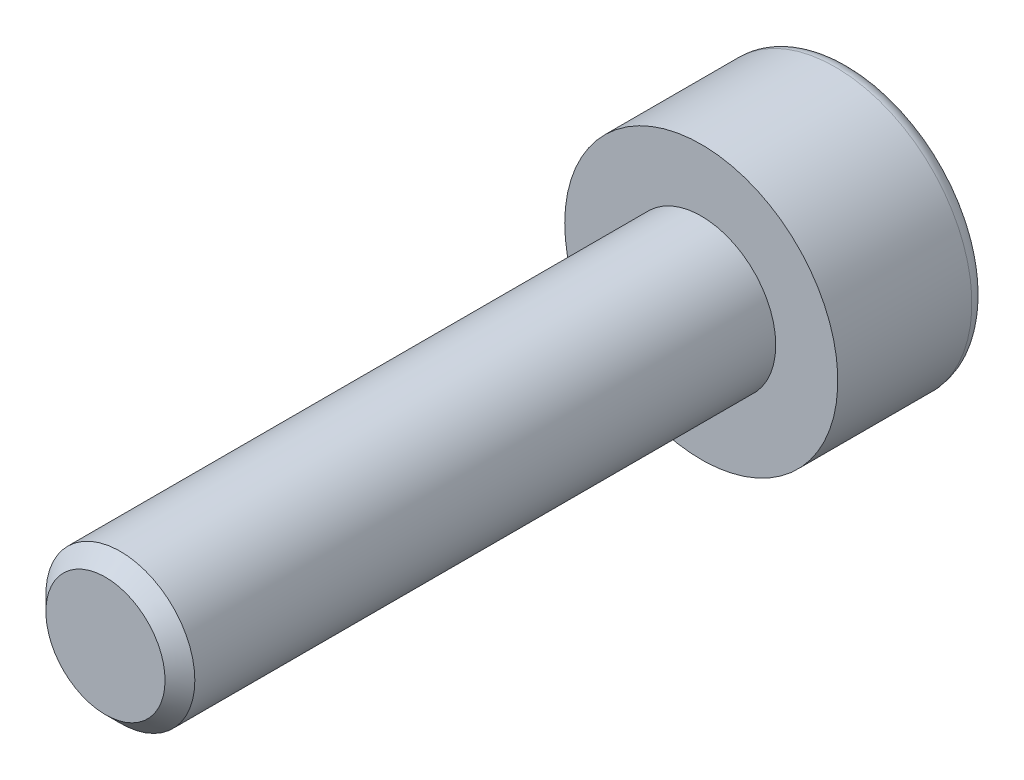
ISO-10303-21;
HEADER;
FILE_DESCRIPTION(('STEP AP214'),'2;1');
FILE_NAME('part.step','',(''),(''),'','','');
FILE_SCHEMA(('AUTOMOTIVE_DESIGN { 1 0 10303 214 1 1 1 1 }'));
ENDSEC;
DATA;
#1=APPLICATION_CONTEXT('core data for automotive mechanical design processes');
#2=APPLICATION_PROTOCOL_DEFINITION('international standard','automotive_design',2000,#1);
#3=PRODUCT_CONTEXT('',#1,'mechanical');
#4=PRODUCT('Part','Part','',(#3));
#5=PRODUCT_RELATED_PRODUCT_CATEGORY('part','',(#4));
#6=PRODUCT_DEFINITION_FORMATION('','',#4);
#7=PRODUCT_DEFINITION_CONTEXT('part definition',#1,'design');
#8=PRODUCT_DEFINITION('design','',#6,#7);
#9=PRODUCT_DEFINITION_SHAPE('','',#8);
#10=(LENGTH_UNIT() NAMED_UNIT(*) SI_UNIT(.MILLI.,.METRE.));
#11=(NAMED_UNIT(*) PLANE_ANGLE_UNIT() SI_UNIT($,.RADIAN.));
#12=(NAMED_UNIT(*) SI_UNIT($,.STERADIAN.) SOLID_ANGLE_UNIT());
#13=UNCERTAINTY_MEASURE_WITH_UNIT(LENGTH_MEASURE(1.E-05),#10,'distance_accuracy_value','');
#14=(GEOMETRIC_REPRESENTATION_CONTEXT(3) GLOBAL_UNCERTAINTY_ASSIGNED_CONTEXT((#13)) GLOBAL_UNIT_ASSIGNED_CONTEXT((#10,
#11,#12)) REPRESENTATION_CONTEXT('',''));
#15=CARTESIAN_POINT('',(0.,0.,0.));
#16=DIRECTION('',(0.,0.,1.));
#17=DIRECTION('',(1.,0.,0.));
#18=AXIS2_PLACEMENT_3D('',#15,#16,#17);
#19=CARTESIAN_POINT('',(0.,1.20361847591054E-13,-3.));
#20=DIRECTION('',(0.,0.,1.));
#21=DIRECTION('',(1.,0.,0.));
#22=AXIS2_PLACEMENT_3D('',#19,#20,#21);
#23=PLANE('',#22);
#24=CARTESIAN_POINT('',(0.,1.20361847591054E-13,-2.99999999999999));
#25=DIRECTION('',(0.,0.,-1.));
#26=DIRECTION('',(-1.,0.,0.));
#27=AXIS2_PLACEMENT_3D('',#24,#25,#26);
#28=CIRCLE('',#27,2.45);
#29=CARTESIAN_POINT('',(-2.44999999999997,1.21041859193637E-13,-2.99999999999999));
#30=VERTEX_POINT('',#29);
#31=EDGE_CURVE('E140',#30,#30,#28,.T.);
#32=ORIENTED_EDGE('',*,*,#31,.T.);
#33=EDGE_LOOP('',(#32));
#34=FACE_BOUND('',#33,.T.);
#35=DIRECTION('',(-0.86602540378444,0.499999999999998,0.));
#36=VECTOR('',#35,1.);
#37=CARTESIAN_POINT('',(0.,1.44337567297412,-3.00000000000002));
#38=LINE('',#37,#36);
#39=CARTESIAN_POINT('',(1.25000000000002,0.721687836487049,-3.00000000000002));
#40=VERTEX_POINT('',#39);
#41=CARTESIAN_POINT('',(0.,1.44337567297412,-3.00000000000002));
#42=VERTEX_POINT('',#41);
#43=EDGE_CURVE('E44',#40,#42,#38,.T.);
#44=ORIENTED_EDGE('',*,*,#43,.T.);
#45=DIRECTION('',(-0.866025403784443,-0.500000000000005,0.));
#46=VECTOR('',#45,1.);
#47=CARTESIAN_POINT('',(0.,1.44337567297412,-3.00000000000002));
#48=LINE('',#47,#46);
#49=CARTESIAN_POINT('',(-1.25,0.721687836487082,-2.99999999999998));
#50=VERTEX_POINT('',#49);
#51=EDGE_CURVE('E84',#42,#50,#48,.T.);
#52=ORIENTED_EDGE('',*,*,#51,.T.);
#53=DIRECTION('',(0.,-1.,0.));
#54=VECTOR('',#53,1.);
#55=CARTESIAN_POINT('',(-1.25000000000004,-0.721687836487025,-3.00000000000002));
#56=LINE('',#55,#54);
#57=CARTESIAN_POINT('',(-1.25000000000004,-0.721687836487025,-3.00000000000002));
#58=VERTEX_POINT('',#57);
#59=EDGE_CURVE('E92',#50,#58,#56,.T.);
#60=ORIENTED_EDGE('',*,*,#59,.T.);
#61=DIRECTION('',(0.866025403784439,-0.500000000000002,0.));
#62=VECTOR('',#61,1.);
#63=CARTESIAN_POINT('',(0.,-1.44337567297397,-2.99999999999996));
#64=LINE('',#63,#62);
#65=CARTESIAN_POINT('',(0.,-1.44337567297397,-2.99999999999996));
#66=VERTEX_POINT('',#65);
#67=EDGE_CURVE('E110',#58,#66,#64,.T.);
#68=ORIENTED_EDGE('',*,*,#67,.T.);
#69=DIRECTION('',(0.86602540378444,0.499999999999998,0.));
#70=VECTOR('',#69,1.);
#71=CARTESIAN_POINT('',(0.,-1.44337567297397,-2.99999999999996));
#72=LINE('',#71,#70);
#73=CARTESIAN_POINT('',(1.24999999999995,-0.721687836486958,-2.99999999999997));
#74=VERTEX_POINT('',#73);
#75=EDGE_CURVE('E113',#66,#74,#72,.T.);
#76=ORIENTED_EDGE('',*,*,#75,.T.);
#77=DIRECTION('',(0.,1.,0.));
#78=VECTOR('',#77,1.);
#79=CARTESIAN_POINT('',(1.24999999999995,-0.721687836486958,-2.99999999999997));
#80=LINE('',#79,#78);
#81=EDGE_CURVE('E103',#74,#40,#80,.T.);
#82=ORIENTED_EDGE('',*,*,#81,.T.);
#83=EDGE_LOOP('',(#44,#52,#60,#68,#76,#82));
#84=FACE_BOUND('',#83,.T.);
#85=ADVANCED_FACE('F30',(#34,#84),#23,.F.);
#86=CARTESIAN_POINT('',(0.,1.56630997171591E-13,-2.7));
#87=DIRECTION('',(0.,0.,-1.));
#88=DIRECTION('',(-1.,0.,0.));
#89=AXIS2_PLACEMENT_3D('',#86,#87,#88);
#90=TOROIDAL_SURFACE('',#89,2.45,0.299999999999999);
#91=ORIENTED_EDGE('',*,*,#31,.F.);
#92=EDGE_LOOP('',(#91));
#93=FACE_BOUND('',#92,.T.);
#94=CARTESIAN_POINT('',(0.,1.56630997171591E-13,-2.7));
#95=DIRECTION('',(0.,0.,-1.));
#96=DIRECTION('',(-1.,0.,0.));
#97=AXIS2_PLACEMENT_3D('',#94,#95,#96);
#98=CIRCLE('',#97,2.75);
#99=CARTESIAN_POINT('',(-2.75,1.57394275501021E-13,-2.7));
#100=VERTEX_POINT('',#99);
#101=EDGE_CURVE('E137',#100,#100,#98,.T.);
#102=ORIENTED_EDGE('',*,*,#101,.T.);
#103=EDGE_LOOP('',(#102));
#104=FACE_BOUND('',#103,.T.);
#105=ADVANCED_FACE('F159',(#93,#104),#90,.T.);
#106=CARTESIAN_POINT('',(0.,0.,0.));
#107=DIRECTION('',(0.,0.,-1.));
#108=DIRECTION('',(-1.,0.,0.));
#109=AXIS2_PLACEMENT_3D('',#106,#107,#108);
#110=CYLINDRICAL_SURFACE('',#109,2.75);
#111=ORIENTED_EDGE('',*,*,#101,.F.);
#112=EDGE_LOOP('',(#111));
#113=FACE_BOUND('',#112,.T.);
#114=CARTESIAN_POINT('',(0.,0.,0.));
#115=DIRECTION('',(0.,0.,-1.));
#116=DIRECTION('',(-1.,0.,0.));
#117=AXIS2_PLACEMENT_3D('',#114,#115,#116);
#118=CIRCLE('',#117,2.75);
#119=CARTESIAN_POINT('',(-2.75,0.,0.));
#120=VERTEX_POINT('',#119);
#121=EDGE_CURVE('E98',#120,#120,#118,.T.);
#122=ORIENTED_EDGE('',*,*,#121,.T.);
#123=EDGE_LOOP('',(#122));
#124=FACE_BOUND('',#123,.T.);
#125=ADVANCED_FACE('F164',(#113,#124),#110,.T.);
#126=CARTESIAN_POINT('',(0.,0.,0.));
#127=DIRECTION('',(0.,0.,-1.));
#128=DIRECTION('',(-1.,0.,0.));
#129=AXIS2_PLACEMENT_3D('',#126,#127,#128);
#130=PLANE('',#129);
#131=CARTESIAN_POINT('',(0.,0.,0.));
#132=DIRECTION('',(0.,0.,1.));
#133=DIRECTION('',(1.,0.,0.));
#134=AXIS2_PLACEMENT_3D('',#131,#132,#133);
#135=CIRCLE('',#134,1.5);
#136=CARTESIAN_POINT('',(1.5,0.,0.));
#137=VERTEX_POINT('',#136);
#138=EDGE_CURVE('E104',#137,#137,#135,.T.);
#139=ORIENTED_EDGE('',*,*,#138,.F.);
#140=EDGE_LOOP('',(#139));
#141=FACE_BOUND('',#140,.T.);
#142=ORIENTED_EDGE('',*,*,#121,.F.);
#143=EDGE_LOOP('',(#142));
#144=FACE_BOUND('',#143,.T.);
#145=ADVANCED_FACE('F172',(#141,#144),#130,.F.);
#146=CARTESIAN_POINT('',(0.,1.4433756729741,-1.7));
#147=DIRECTION('',(-0.499999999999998,-0.86602540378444,0.));
#148=DIRECTION('',(0.86602540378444,-0.499999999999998,0.));
#149=AXIS2_PLACEMENT_3D('',#146,#147,#148);
#150=PLANE('',#149);
#151=ORIENTED_EDGE('',*,*,#43,.F.);
#152=DIRECTION('',(0.,0.,-1.));
#153=VECTOR('',#152,1.);
#154=CARTESIAN_POINT('',(1.25000000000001,0.721687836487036,-1.70000000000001));
#155=LINE('',#154,#153);
#156=CARTESIAN_POINT('',(1.25000000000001,0.721687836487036,-1.70000000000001));
#157=VERTEX_POINT('',#156);
#158=EDGE_CURVE('E126',#157,#40,#155,.T.);
#159=ORIENTED_EDGE('',*,*,#158,.F.);
#160=DIRECTION('',(-0.86602540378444,0.499999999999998,0.));
#161=VECTOR('',#160,1.);
#162=CARTESIAN_POINT('',(0.,1.4433756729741,-1.7));
#163=LINE('',#162,#161);
#164=CARTESIAN_POINT('',(0.,1.4433756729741,-1.7));
#165=VERTEX_POINT('',#164);
#166=EDGE_CURVE('E97',#157,#165,#163,.T.);
#167=ORIENTED_EDGE('',*,*,#166,.T.);
#168=DIRECTION('',(0.,0.,-1.));
#169=VECTOR('',#168,1.);
#170=CARTESIAN_POINT('',(0.,1.4433756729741,-1.7));
#171=LINE('',#170,#169);
#172=EDGE_CURVE('E86',#165,#42,#171,.T.);
#173=ORIENTED_EDGE('',*,*,#172,.T.);
#174=EDGE_LOOP('',(#151,#159,#167,#173));
#175=FACE_BOUND('',#174,.T.);
#176=ADVANCED_FACE('F95',(#175),#150,.T.);
#177=CARTESIAN_POINT('',(0.,1.4433756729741,-1.7));
#178=DIRECTION('',(0.500000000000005,-0.866025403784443,0.));
#179=DIRECTION('',(0.866025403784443,0.500000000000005,0.));
#180=AXIS2_PLACEMENT_3D('',#177,#178,#179);
#181=PLANE('',#180);
#182=ORIENTED_EDGE('',*,*,#51,.F.);
#183=ORIENTED_EDGE('',*,*,#172,.F.);
#184=DIRECTION('',(-0.866025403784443,-0.500000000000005,0.));
#185=VECTOR('',#184,1.);
#186=CARTESIAN_POINT('',(0.,1.4433756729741,-1.7));
#187=LINE('',#186,#185);
#188=CARTESIAN_POINT('',(-1.24999999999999,0.721687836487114,-1.7));
#189=VERTEX_POINT('',#188);
#190=EDGE_CURVE('E117',#165,#189,#187,.T.);
#191=ORIENTED_EDGE('',*,*,#190,.T.);
#192=DIRECTION('',(0.,0.,-1.));
#193=VECTOR('',#192,1.);
#194=CARTESIAN_POINT('',(-1.24999999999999,0.721687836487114,-1.7));
#195=LINE('',#194,#193);
#196=EDGE_CURVE('E88',#189,#50,#195,.T.);
#197=ORIENTED_EDGE('',*,*,#196,.T.);
#198=EDGE_LOOP('',(#182,#183,#191,#197));
#199=FACE_BOUND('',#198,.T.);
#200=ADVANCED_FACE('F85',(#199),#181,.T.);
#201=CARTESIAN_POINT('',(-1.25000000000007,-0.721687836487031,-1.69999999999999));
#202=DIRECTION('',(1.,0.,0.));
#203=DIRECTION('',(0.,0.,-1.));
#204=AXIS2_PLACEMENT_3D('',#201,#202,#203);
#205=PLANE('',#204);
#206=ORIENTED_EDGE('',*,*,#59,.F.);
#207=ORIENTED_EDGE('',*,*,#196,.F.);
#208=DIRECTION('',(0.,-1.,0.));
#209=VECTOR('',#208,1.);
#210=CARTESIAN_POINT('',(-1.25000000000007,-0.721687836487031,-1.69999999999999));
#211=LINE('',#210,#209);
#212=CARTESIAN_POINT('',(-1.25000000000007,-0.721687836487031,-1.69999999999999));
#213=VERTEX_POINT('',#212);
#214=EDGE_CURVE('E119',#189,#213,#211,.T.);
#215=ORIENTED_EDGE('',*,*,#214,.T.);
#216=DIRECTION('',(0.,0.,-1.));
#217=VECTOR('',#216,1.);
#218=CARTESIAN_POINT('',(-1.25000000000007,-0.721687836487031,-1.69999999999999));
#219=LINE('',#218,#217);
#220=EDGE_CURVE('E132',#213,#58,#219,.T.);
#221=ORIENTED_EDGE('',*,*,#220,.T.);
#222=EDGE_LOOP('',(#206,#207,#215,#221));
#223=FACE_BOUND('',#222,.T.);
#224=ADVANCED_FACE('F187',(#223),#205,.T.);
#225=CARTESIAN_POINT('',(0.,-1.44337567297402,-1.7));
#226=DIRECTION('',(0.500000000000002,0.866025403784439,0.));
#227=DIRECTION('',(-0.866025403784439,0.500000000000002,0.));
#228=AXIS2_PLACEMENT_3D('',#225,#226,#227);
#229=PLANE('',#228);
#230=ORIENTED_EDGE('',*,*,#67,.F.);
#231=ORIENTED_EDGE('',*,*,#220,.F.);
#232=DIRECTION('',(0.866025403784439,-0.500000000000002,0.));
#233=VECTOR('',#232,1.);
#234=CARTESIAN_POINT('',(0.,-1.44337567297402,-1.7));
#235=LINE('',#234,#233);
#236=CARTESIAN_POINT('',(0.,-1.44337567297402,-1.7));
#237=VERTEX_POINT('',#236);
#238=EDGE_CURVE('E121',#213,#237,#235,.T.);
#239=ORIENTED_EDGE('',*,*,#238,.T.);
#240=DIRECTION('',(0.,0.,-1.));
#241=VECTOR('',#240,1.);
#242=CARTESIAN_POINT('',(0.,-1.44337567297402,-1.7));
#243=LINE('',#242,#241);
#244=EDGE_CURVE('E130',#237,#66,#243,.T.);
#245=ORIENTED_EDGE('',*,*,#244,.T.);
#246=EDGE_LOOP('',(#230,#231,#239,#245));
#247=FACE_BOUND('',#246,.T.);
#248=ADVANCED_FACE('F190',(#247),#229,.T.);
#249=CARTESIAN_POINT('',(0.,-1.44337567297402,-1.7));
#250=DIRECTION('',(-0.499999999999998,0.86602540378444,0.));
#251=DIRECTION('',(-0.86602540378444,-0.499999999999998,0.));
#252=AXIS2_PLACEMENT_3D('',#249,#250,#251);
#253=PLANE('',#252);
#254=ORIENTED_EDGE('',*,*,#75,.F.);
#255=ORIENTED_EDGE('',*,*,#244,.F.);
#256=DIRECTION('',(0.86602540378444,0.499999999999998,0.));
#257=VECTOR('',#256,1.);
#258=CARTESIAN_POINT('',(0.,-1.44337567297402,-1.7));
#259=LINE('',#258,#257);
#260=CARTESIAN_POINT('',(1.24999999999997,-0.721687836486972,-1.69999999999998));
#261=VERTEX_POINT('',#260);
#262=EDGE_CURVE('E123',#237,#261,#259,.T.);
#263=ORIENTED_EDGE('',*,*,#262,.T.);
#264=DIRECTION('',(0.,0.,-1.));
#265=VECTOR('',#264,1.);
#266=CARTESIAN_POINT('',(1.24999999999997,-0.721687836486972,-1.69999999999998));
#267=LINE('',#266,#265);
#268=EDGE_CURVE('E128',#261,#74,#267,.T.);
#269=ORIENTED_EDGE('',*,*,#268,.T.);
#270=EDGE_LOOP('',(#254,#255,#263,#269));
#271=FACE_BOUND('',#270,.T.);
#272=ADVANCED_FACE('F194',(#271),#253,.T.);
#273=CARTESIAN_POINT('',(1.24999999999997,-0.721687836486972,-1.69999999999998));
#274=DIRECTION('',(-1.,0.,0.));
#275=DIRECTION('',(0.,0.,1.));
#276=AXIS2_PLACEMENT_3D('',#273,#274,#275);
#277=PLANE('',#276);
#278=ORIENTED_EDGE('',*,*,#81,.F.);
#279=ORIENTED_EDGE('',*,*,#268,.F.);
#280=DIRECTION('',(0.,1.,0.));
#281=VECTOR('',#280,1.);
#282=CARTESIAN_POINT('',(1.24999999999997,-0.721687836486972,-1.69999999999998));
#283=LINE('',#282,#281);
#284=EDGE_CURVE('E51',#261,#157,#283,.T.);
#285=ORIENTED_EDGE('',*,*,#284,.T.);
#286=ORIENTED_EDGE('',*,*,#158,.T.);
#287=EDGE_LOOP('',(#278,#279,#285,#286));
#288=FACE_BOUND('',#287,.T.);
#289=ADVANCED_FACE('F198',(#288),#277,.T.);
#290=CARTESIAN_POINT('',(1.25000000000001,0.721687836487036,-1.70000000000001));
#291=DIRECTION('',(0.,0.,1.));
#292=DIRECTION('',(1.,0.,0.));
#293=AXIS2_PLACEMENT_3D('',#290,#291,#292);
#294=PLANE('',#293);
#295=ORIENTED_EDGE('',*,*,#166,.F.);
#296=ORIENTED_EDGE('',*,*,#284,.F.);
#297=ORIENTED_EDGE('',*,*,#262,.F.);
#298=ORIENTED_EDGE('',*,*,#238,.F.);
#299=ORIENTED_EDGE('',*,*,#214,.F.);
#300=ORIENTED_EDGE('',*,*,#190,.F.);
#301=EDGE_LOOP('',(#295,#296,#297,#298,#299,#300));
#302=FACE_BOUND('',#301,.T.);
#303=ADVANCED_FACE('F202',(#302),#294,.F.);
#304=CARTESIAN_POINT('',(0.,0.,12.));
#305=DIRECTION('',(0.,0.,1.));
#306=DIRECTION('',(1.,0.,0.));
#307=AXIS2_PLACEMENT_3D('',#304,#305,#306);
#308=PLANE('',#307);
#309=CARTESIAN_POINT('',(0.,0.,12.));
#310=DIRECTION('',(0.,0.,1.));
#311=DIRECTION('',(1.,0.,0.));
#312=AXIS2_PLACEMENT_3D('',#309,#310,#311);
#313=CIRCLE('',#312,1.2);
#314=CARTESIAN_POINT('',(1.20000000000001,0.,12.));
#315=VERTEX_POINT('',#314);
#316=EDGE_CURVE('E37',#315,#315,#313,.T.);
#317=ORIENTED_EDGE('',*,*,#316,.T.);
#318=EDGE_LOOP('',(#317));
#319=FACE_BOUND('',#318,.T.);
#320=ADVANCED_FACE('F145',(#319),#308,.T.);
#321=CARTESIAN_POINT('',(0.,0.,0.));
#322=DIRECTION('',(0.,0.,1.));
#323=DIRECTION('',(1.,0.,0.));
#324=AXIS2_PLACEMENT_3D('',#321,#322,#323);
#325=CYLINDRICAL_SURFACE('',#324,1.5);
#326=CARTESIAN_POINT('',(0.,0.,11.7));
#327=DIRECTION('',(0.,0.,1.));
#328=DIRECTION('',(1.,0.,0.));
#329=AXIS2_PLACEMENT_3D('',#326,#327,#328);
#330=CIRCLE('',#329,1.5);
#331=CARTESIAN_POINT('',(1.50000000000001,0.,11.7));
#332=VERTEX_POINT('',#331);
#333=EDGE_CURVE('E11',#332,#332,#330,.F.);
#334=ORIENTED_EDGE('',*,*,#333,.T.);
#335=EDGE_LOOP('',(#334));
#336=FACE_BOUND('',#335,.T.);
#337=ORIENTED_EDGE('',*,*,#138,.T.);
#338=EDGE_LOOP('',(#337));
#339=FACE_BOUND('',#338,.T.);
#340=ADVANCED_FACE('F149',(#336,#339),#325,.T.);
#341=CARTESIAN_POINT('',(0.,0.,12.));
#342=DIRECTION('',(0.,0.,-1.));
#343=DIRECTION('',(-1.,0.,0.));
#344=AXIS2_PLACEMENT_3D('',#341,#342,#343);
#345=CONICAL_SURFACE('',#344,1.2,0.785398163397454);
#346=ORIENTED_EDGE('',*,*,#333,.F.);
#347=EDGE_LOOP('',(#346));
#348=FACE_BOUND('',#347,.T.);
#349=ORIENTED_EDGE('',*,*,#316,.F.);
#350=EDGE_LOOP('',(#349));
#351=FACE_BOUND('',#350,.T.);
#352=ADVANCED_FACE('F147',(#348,#351),#345,.T.);
#353=CLOSED_SHELL('',(#85,#105,#125,#145,#176,#200,#224,#248,#272,#289,#303,#320,#340,#352));
#354=MANIFOLD_SOLID_BREP('B2',#353);
#355=ADVANCED_BREP_SHAPE_REPRESENTATION('',(#18,#354),#14);
#356=SHAPE_DEFINITION_REPRESENTATION(#9,#355);
ENDSEC;
END-ISO-10303-21;
